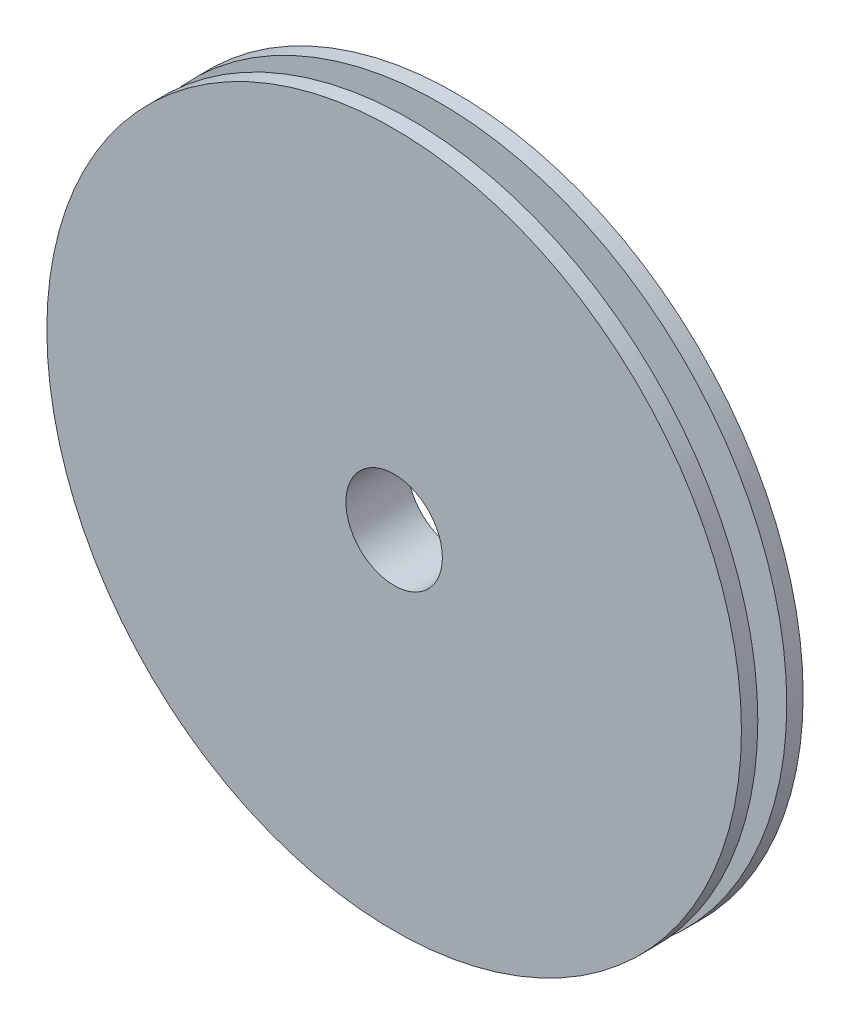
from build123d import *

# Parameters (mm, degrees)
SKETCH1_R               = 18
BOSS_EXTRUDE1_DEPTH     = 3.2
CUT_EXTRUDE1_DEPTH      = 17
CUT_EXTRUDE1_DEPTH_BACK = 43
SKETCH2_R               = 2.5
SKETCH5_R               = 18
SKETCH5_R_2             = 15.5
CUT_EXTRUDE4_DEPTH      = 0.75


with BuildPart() as part:
    # Sketch1 → Boss-Extrude1 (new body)
    with BuildSketch(Plane.XY):
        Circle(SKETCH1_R)
    extrude(amount=BOSS_EXTRUDE1_DEPTH)

    # Sketch2 → Cut-Extrude1 (cut, two sides: drawn at the far end of the back side and taken through both)
    with BuildSketch(Plane.XY.offset(3.2).offset(-CUT_EXTRUDE1_DEPTH_BACK)):
        Circle(SKETCH2_R)
    extrude(amount=CUT_EXTRUDE1_DEPTH + CUT_EXTRUDE1_DEPTH_BACK, mode=Mode.SUBTRACT)

    # Sketch5 → Cut-Extrude4 (cut, symmetric)
    with BuildSketch(Plane.XY.offset(1.6)):
        Circle(SKETCH5_R)
        Circle(SKETCH5_R_2, mode=Mode.SUBTRACT)
    extrude(amount=CUT_EXTRUDE4_DEPTH, both=True, mode=Mode.SUBTRACT)


solid = part.part
